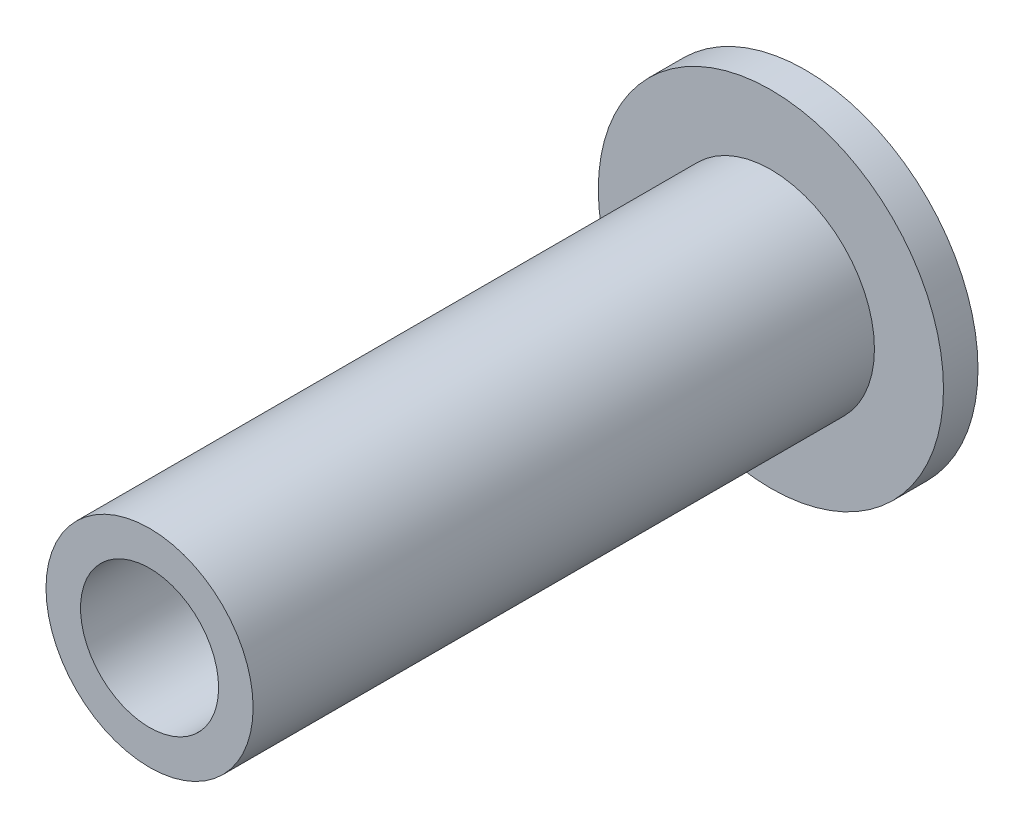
from build123d import *


with BuildPart() as part:
    # Esquisse1 → R_volution1 (revolve)
    with BuildSketch(Plane(origin=(0, 0, 0), x_dir=(0, 0, -1), z_dir=(1, 0, 0)), mode=Mode.PRIVATE) as r_volution1_sk:
        with BuildLine():
            Line((-18, 3), (0, 3))
            Line((0, 3), (0, 5))
            Line((0, 5), (1, 5))
            ThreePointArc((1, 5), (1.357034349, 2.511322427), (1.47640459, 0))
            Line((1.47640459, 0), (0, 0))
            Line((0, 0), (-1.154700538, 2))
            Line((-1.154700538, 2), (-18, 2))
            Line((-18, 2), (-18, 3))
        make_face()
    revolve(r_volution1_sk.sketch.rotate(Axis((0, 0, 27.655172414), (0, 0, -1)), 90), axis=Axis((0, 0, 27.655172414), (0, 0, -1)))


solid = part.part
